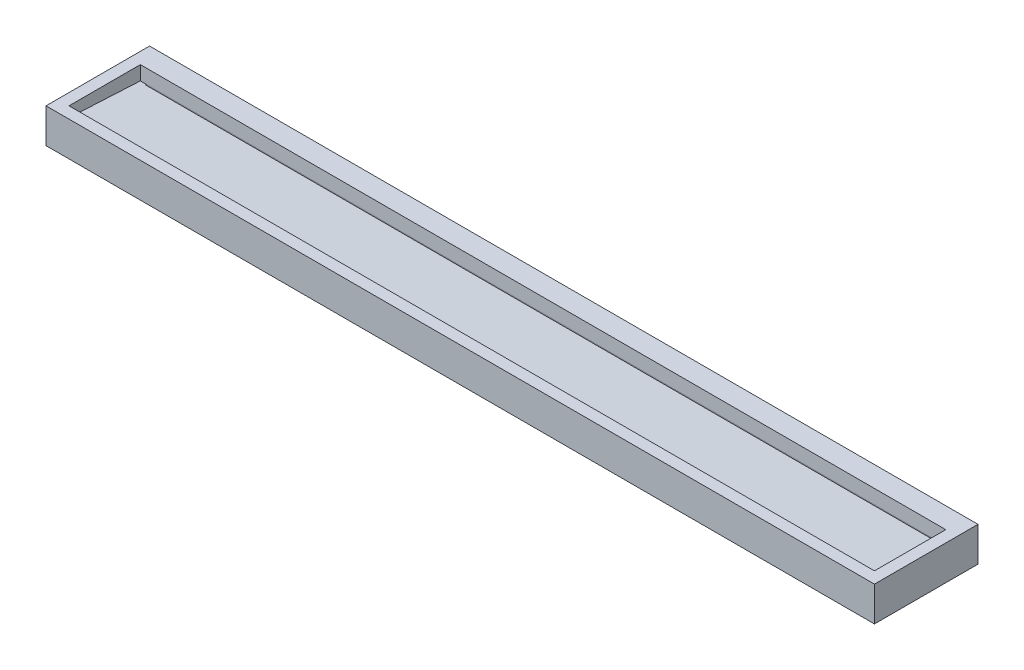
from build123d import *

# Parameters (mm, degrees)
SKETCH1_W                 = 3600
SKETCH1_H                 = 450
BODY_DEPTH                = 150
BASIN_START               = -50
BASIN_CUTOUT_DEPTH        = 3500
SHELL1_T                  = -12
SKETCH3_W                 = 3576
SKETCH3_H                 = 276
BACK_CUTOUT_DEPTH         = 12
SKETCH4_W                 = 3600
SKETCH4_H                 = 12
SUPPORT_RIBS_DEPTH        = 97
SKETCH8_W                 = 190
SKETCH8_H                 = 23.73712027
WASTE_PLATE_CUTOUT_DEPTH  = 12
SKETCH11_R                = 4
BRACKET_HOLE_DEPTH        = 12
HOLE_PATTERN_COUNT        = 61
HOLE_PATTERN_PITCH        = 58.8333
SKETCH12_W                = 3576
SKETCH12_H                = 4
BRACKET_SLOT_DEPTH        = 6
SKETCH9_W                 = 3450
SKETCH9_H                 = 4
DRAINAGE_SLOT_LONG_DEPTH  = 6
SKETCH10_W                = 140
SKETCH10_H                = 4
DRAINAGE_SLOT_SHORT_DEPTH = 12
USER_SPACING_COUNT        = 6
USER_SPACING_PITCH        = 600


with BuildPart() as part:
    # Sketch1 → Body (new body)
    with BuildSketch(Plane(origin=(0, 0, 0), x_dir=(1, 0, 0), z_dir=(0, 1, 0))):
        Rectangle(SKETCH1_W, SKETCH1_H)
    extrude(amount=BODY_DEPTH)

    # Sketch2 → Basin Cutout (cut)
    with BuildSketch(Plane(origin=(1800, 0, 0), x_dir=(0, 0, -1), z_dir=(1, 0, 0)).offset(BASIN_START)):
        Polygon((-175, 150), (-175, 105), (135, 88.753588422), (135, 150), align=None)
    extrude(amount=-BASIN_CUTOUT_DEPTH, mode=Mode.SUBTRACT)

    # Shell1
    shell1_openings = [part.faces().sort_by_distance(p)[0] for p in [
        (0, 0, 0),
    ]]
    offset(amount=SHELL1_T, openings=shell1_openings, kind=Kind.INTERSECTION)

    # Sketch3 → Back Cutout (cut)
    with BuildSketch(Plane(origin=(0, 0, -225), x_dir=(-1, 0, 0), z_dir=(0, 0, -1))):
        Rectangle(SKETCH3_W, SKETCH3_H)
    extrude(amount=-BACK_CUTOUT_DEPTH, mode=Mode.SUBTRACT)

    # Sketch4 → Support Ribs (add)
    with BuildSketch(Plane(origin=(0, 150, 0), x_dir=(1, 0, 0), z_dir=(0, 1, 0))):
        with Locations((0, 141)):
            Rectangle(SKETCH4_W, SKETCH4_H)
        with Locations((0, -181)):
            Rectangle(SKETCH4_W, SKETCH4_H)
    extrude(amount=-SUPPORT_RIBS_DEPTH)

    # Sketch8 → Waste Plate Cutout (cut)
    with BuildSketch(Plane(origin=(0, 0, -147), x_dir=(-1, 0, 0), z_dir=(0, 0, -1))):
        with Locations((-1500, 64.868560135)):
            Rectangle(SKETCH8_W, SKETCH8_H)
    waste_plate_cutout = extrude(amount=-WASTE_PLATE_CUTOUT_DEPTH, mode=Mode.SUBTRACT)

    # Sketch11 → Bracket Hole (cut)
    with BuildSketch(Plane(origin=(0, 0, 175), x_dir=(-1, 0, 0), z_dir=(0, 0, -1))):
        with Locations((-1765, 65.8)):
            Circle(SKETCH11_R)
    bracket_hole = extrude(amount=-BRACKET_HOLE_DEPTH, mode=Mode.SUBTRACT)

    # Hole Pattern: Bracket Hole ×61
    with Locations(*[(-i * HOLE_PATTERN_PITCH, 0, 0) for i in range(1, HOLE_PATTERN_COUNT)]):
        add(bracket_hole, mode=Mode.SUBTRACT)

    # Sketch12 → Bracket Slot (cut)
    with BuildSketch(Plane(origin=(0, 0, -147), x_dir=(-1, 0, 0), z_dir=(0, 0, -1))):
        with Locations((0, 63)):
            Rectangle(SKETCH12_W, SKETCH12_H)
    extrude(amount=-BRACKET_SLOT_DEPTH, mode=Mode.SUBTRACT)

    # Sketch9 → Drainage Slot Long (cut)
    with BuildSketch(Plane(origin=(0, 95.566158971, -5.008410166), x_dir=(1, 0, 0), z_dir=(0, 0.9986295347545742, -0.052335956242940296))):
        with Locations((0, 128.169983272)):
            Rectangle(SKETCH9_W, SKETCH9_H)
    extrude(amount=-DRAINAGE_SLOT_LONG_DEPTH, mode=Mode.SUBTRACT)

    # Sketch10 → Drainage Slot Short (cut)
    with BuildSketch(Plane(origin=(0, 95.566158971, -5.008410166), x_dir=(1, 0, 0), z_dir=(0, 0.9986295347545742, -0.052335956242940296))):
        with Locations((1500, 128.169983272)):
            Rectangle(SKETCH10_W, SKETCH10_H)
    drainage_slot_short = extrude(amount=-DRAINAGE_SLOT_SHORT_DEPTH, mode=Mode.SUBTRACT)

    # User Spacing: Waste Plate Cutout, Drainage Slot Short ×6
    with Locations(*[(-i * USER_SPACING_PITCH, 0, 0) for i in range(1, USER_SPACING_COUNT)]):
        add(waste_plate_cutout, mode=Mode.SUBTRACT)
        add(drainage_slot_short, mode=Mode.SUBTRACT)


solid = part.part
